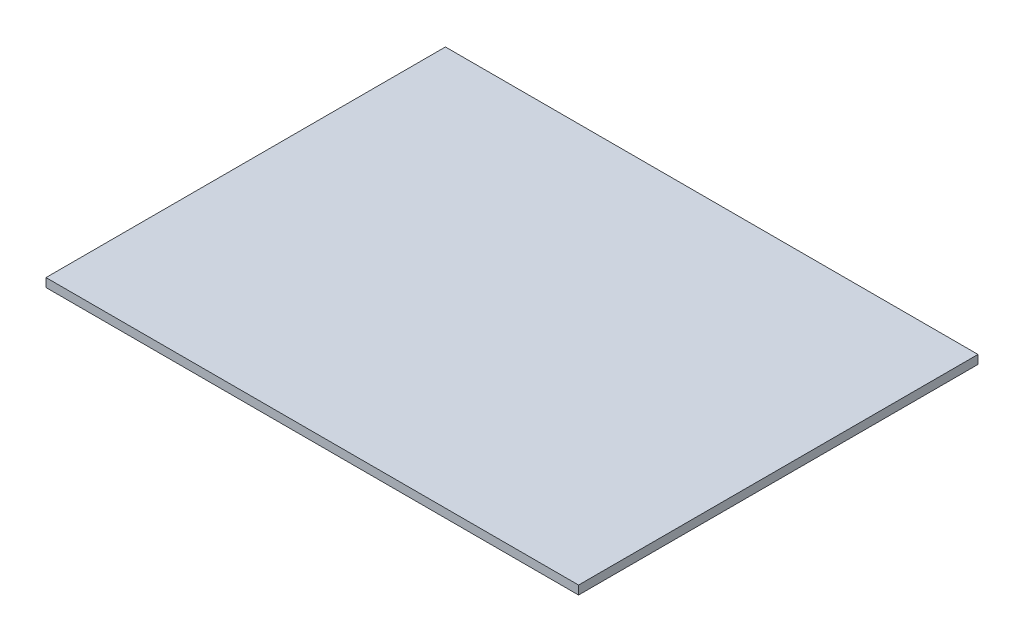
from build123d import *

# Parameters (mm, degrees)
SKETCH2_W           = 1168.4
SKETCH2_H           = 876.3
BOSS_EXTRUDE1_DEPTH = 19.05


with BuildPart() as part:
    # Sketch2 → Boss-Extrude1 (new body)
    with BuildSketch(Plane(origin=(0, 0, 0), x_dir=(1, 0, 0), z_dir=(0, 1, 0))):
        Rectangle(SKETCH2_W, SKETCH2_H)
    extrude(amount=BOSS_EXTRUDE1_DEPTH)


solid = part.part
